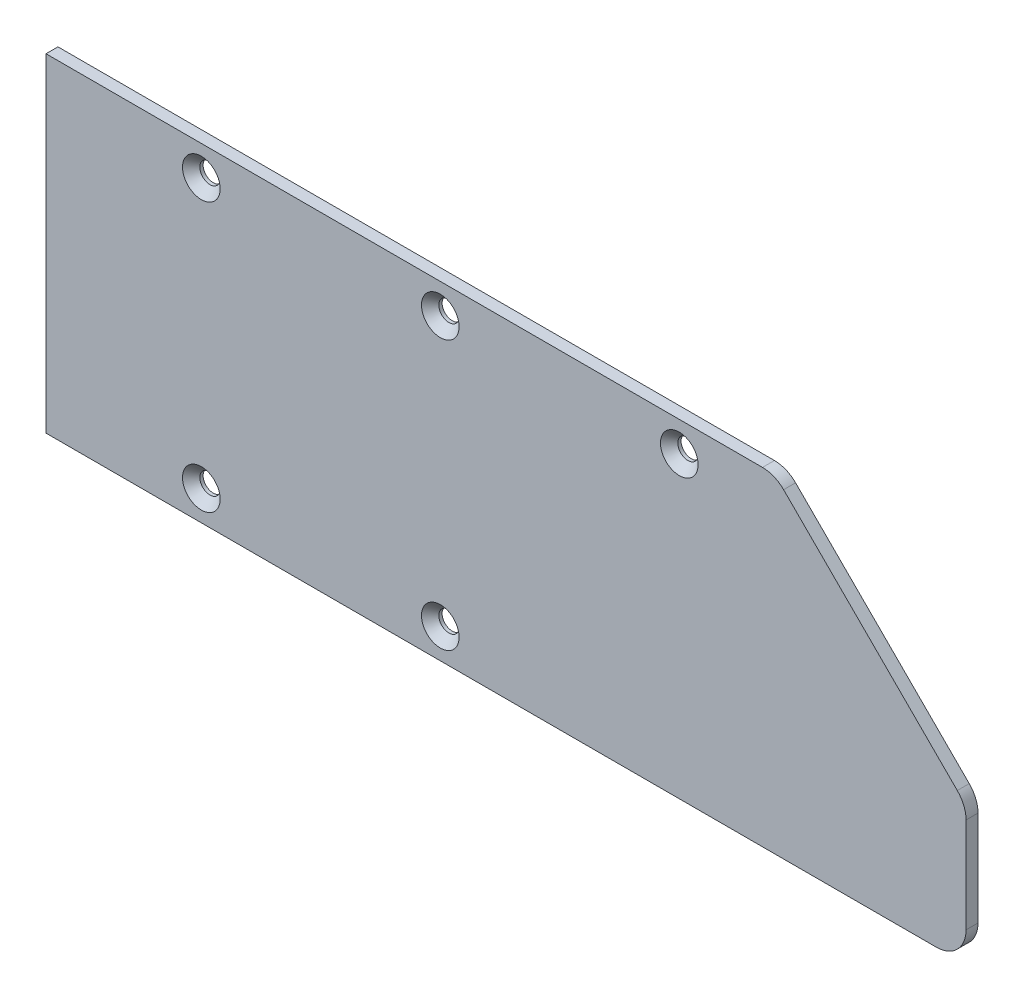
ISO-10303-21;
HEADER;
FILE_DESCRIPTION(('STEP AP214'),'2;1');
FILE_NAME('part.step','',(''),(''),'','','');
FILE_SCHEMA(('AUTOMOTIVE_DESIGN { 1 0 10303 214 1 1 1 1 }'));
ENDSEC;
DATA;
#1=APPLICATION_CONTEXT('core data for automotive mechanical design processes');
#2=APPLICATION_PROTOCOL_DEFINITION('international standard','automotive_design',2000,#1);
#3=PRODUCT_CONTEXT('',#1,'mechanical');
#4=PRODUCT('Part','Part','',(#3));
#5=PRODUCT_RELATED_PRODUCT_CATEGORY('part','',(#4));
#6=PRODUCT_DEFINITION_FORMATION('','',#4);
#7=PRODUCT_DEFINITION_CONTEXT('part definition',#1,'design');
#8=PRODUCT_DEFINITION('design','',#6,#7);
#9=PRODUCT_DEFINITION_SHAPE('','',#8);
#10=(LENGTH_UNIT() NAMED_UNIT(*) SI_UNIT(.MILLI.,.METRE.));
#11=(NAMED_UNIT(*) PLANE_ANGLE_UNIT() SI_UNIT($,.RADIAN.));
#12=(NAMED_UNIT(*) SI_UNIT($,.STERADIAN.) SOLID_ANGLE_UNIT());
#13=UNCERTAINTY_MEASURE_WITH_UNIT(LENGTH_MEASURE(1.E-05),#10,'distance_accuracy_value','');
#14=(GEOMETRIC_REPRESENTATION_CONTEXT(3) GLOBAL_UNCERTAINTY_ASSIGNED_CONTEXT((#13)) GLOBAL_UNIT_ASSIGNED_CONTEXT((#10,
#11,#12)) REPRESENTATION_CONTEXT('',''));
#15=CARTESIAN_POINT('',(0.,0.,0.));
#16=DIRECTION('',(0.,0.,1.));
#17=DIRECTION('',(1.,0.,0.));
#18=AXIS2_PLACEMENT_3D('',#15,#16,#17);
#19=CARTESIAN_POINT('',(0.,55.,0.));
#20=DIRECTION('',(0.,0.,-1.));
#21=DIRECTION('',(-1.,0.,0.));
#22=AXIS2_PLACEMENT_3D('',#19,#20,#21);
#23=PLANE('',#22);
#24=CARTESIAN_POINT('',(66.,5.,0.));
#25=DIRECTION('',(0.,0.,1.));
#26=DIRECTION('',(1.,0.,0.));
#27=AXIS2_PLACEMENT_3D('',#24,#25,#26);
#28=CIRCLE('',#27,1.7);
#29=CARTESIAN_POINT('',(67.7,5.,0.));
#30=VERTEX_POINT('',#29);
#31=EDGE_CURVE('E259',#30,#30,#28,.T.);
#32=ORIENTED_EDGE('',*,*,#31,.T.);
#33=EDGE_LOOP('',(#32));
#34=FACE_BOUND('',#33,.T.);
#35=DIRECTION('',(0.,1.,0.));
#36=VECTOR('',#35,1.);
#37=CARTESIAN_POINT('',(154.,0.,0.));
#38=LINE('',#37,#36);
#39=CARTESIAN_POINT('',(154.,5.,0.));
#40=VERTEX_POINT('',#39);
#41=CARTESIAN_POINT('',(154.,20.9289321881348,0.));
#42=VERTEX_POINT('',#41);
#43=EDGE_CURVE('E109',#40,#42,#38,.T.);
#44=ORIENTED_EDGE('',*,*,#43,.F.);
#45=CARTESIAN_POINT('',(149.,5.,0.));
#46=DIRECTION('',(0.,0.,-1.));
#47=DIRECTION('',(-1.,0.,0.));
#48=AXIS2_PLACEMENT_3D('',#45,#46,#47);
#49=CIRCLE('',#48,5.);
#50=CARTESIAN_POINT('',(149.,0.,0.));
#51=VERTEX_POINT('',#50);
#52=EDGE_CURVE('E106',#40,#51,#49,.T.);
#53=ORIENTED_EDGE('',*,*,#52,.T.);
#54=DIRECTION('',(1.,0.,0.));
#55=VECTOR('',#54,1.);
#56=CARTESIAN_POINT('',(0.,0.,0.));
#57=LINE('',#56,#55);
#58=CARTESIAN_POINT('',(0.,0.,0.));
#59=VERTEX_POINT('',#58);
#60=EDGE_CURVE('E99',#59,#51,#57,.T.);
#61=ORIENTED_EDGE('',*,*,#60,.F.);
#62=DIRECTION('',(0.,-1.,0.));
#63=VECTOR('',#62,1.);
#64=CARTESIAN_POINT('',(0.,0.,0.));
#65=LINE('',#64,#63);
#66=CARTESIAN_POINT('',(0.,55.,0.));
#67=VERTEX_POINT('',#66);
#68=EDGE_CURVE('E105',#67,#59,#65,.T.);
#69=ORIENTED_EDGE('',*,*,#68,.F.);
#70=DIRECTION('',(-1.,0.,0.));
#71=VECTOR('',#70,1.);
#72=CARTESIAN_POINT('',(0.,55.,0.));
#73=LINE('',#72,#71);
#74=CARTESIAN_POINT('',(119.928932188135,55.,0.));
#75=VERTEX_POINT('',#74);
#76=EDGE_CURVE('E133',#75,#67,#73,.T.);
#77=ORIENTED_EDGE('',*,*,#76,.F.);
#78=CARTESIAN_POINT('',(119.928932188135,50.,0.));
#79=DIRECTION('',(0.,0.,-1.));
#80=DIRECTION('',(-1.,0.,0.));
#81=AXIS2_PLACEMENT_3D('',#78,#79,#80);
#82=CIRCLE('',#81,5.);
#83=CARTESIAN_POINT('',(123.464466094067,53.5355339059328,0.));
#84=VERTEX_POINT('',#83);
#85=EDGE_CURVE('E152',#75,#84,#82,.T.);
#86=ORIENTED_EDGE('',*,*,#85,.T.);
#87=DIRECTION('',(0.707106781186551,-0.707106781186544,0.));
#88=VECTOR('',#87,1.);
#89=CARTESIAN_POINT('',(60.9999999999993,116.,0.));
#90=LINE('',#89,#88);
#91=CARTESIAN_POINT('',(152.535533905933,24.4644660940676,0.));
#92=VERTEX_POINT('',#91);
#93=EDGE_CURVE('E119',#84,#92,#90,.T.);
#94=ORIENTED_EDGE('',*,*,#93,.T.);
#95=CARTESIAN_POINT('',(149.,20.9289321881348,0.));
#96=DIRECTION('',(0.,0.,-1.));
#97=DIRECTION('',(-1.,0.,0.));
#98=AXIS2_PLACEMENT_3D('',#95,#96,#97);
#99=CIRCLE('',#98,5.);
#100=EDGE_CURVE('E150',#92,#42,#99,.T.);
#101=ORIENTED_EDGE('',*,*,#100,.T.);
#102=EDGE_LOOP('',(#44,#53,#61,#69,#77,#86,#94,#101));
#103=FACE_BOUND('',#102,.T.);
#104=CARTESIAN_POINT('',(26.,5.,0.));
#105=DIRECTION('',(0.,0.,1.));
#106=DIRECTION('',(1.,0.,0.));
#107=AXIS2_PLACEMENT_3D('',#104,#105,#106);
#108=CIRCLE('',#107,1.7);
#109=CARTESIAN_POINT('',(27.7,5.,0.));
#110=VERTEX_POINT('',#109);
#111=EDGE_CURVE('E263',#110,#110,#108,.T.);
#112=ORIENTED_EDGE('',*,*,#111,.T.);
#113=EDGE_LOOP('',(#112));
#114=FACE_BOUND('',#113,.T.);
#115=CARTESIAN_POINT('',(26.,50.,0.));
#116=DIRECTION('',(0.,0.,1.));
#117=DIRECTION('',(1.,0.,0.));
#118=AXIS2_PLACEMENT_3D('',#115,#116,#117);
#119=CIRCLE('',#118,1.7);
#120=CARTESIAN_POINT('',(27.7,50.,0.));
#121=VERTEX_POINT('',#120);
#122=EDGE_CURVE('E169',#121,#121,#119,.T.);
#123=ORIENTED_EDGE('',*,*,#122,.T.);
#124=EDGE_LOOP('',(#123));
#125=FACE_BOUND('',#124,.T.);
#126=CARTESIAN_POINT('',(66.,50.,0.));
#127=DIRECTION('',(0.,0.,1.));
#128=DIRECTION('',(1.,0.,0.));
#129=AXIS2_PLACEMENT_3D('',#126,#127,#128);
#130=CIRCLE('',#129,1.7);
#131=CARTESIAN_POINT('',(67.7,50.,0.));
#132=VERTEX_POINT('',#131);
#133=EDGE_CURVE('E178',#132,#132,#130,.T.);
#134=ORIENTED_EDGE('',*,*,#133,.T.);
#135=EDGE_LOOP('',(#134));
#136=FACE_BOUND('',#135,.T.);
#137=CARTESIAN_POINT('',(106.,50.,0.));
#138=DIRECTION('',(0.,0.,1.));
#139=DIRECTION('',(1.,0.,0.));
#140=AXIS2_PLACEMENT_3D('',#137,#138,#139);
#141=CIRCLE('',#140,1.7);
#142=CARTESIAN_POINT('',(107.7,50.,0.));
#143=VERTEX_POINT('',#142);
#144=EDGE_CURVE('E187',#143,#143,#141,.T.);
#145=ORIENTED_EDGE('',*,*,#144,.T.);
#146=EDGE_LOOP('',(#145));
#147=FACE_BOUND('',#146,.T.);
#148=ADVANCED_FACE('F33',(#34,#103,#114,#125,#136,#147),#23,.T.);
#149=CARTESIAN_POINT('',(154.,0.,2.));
#150=DIRECTION('',(-1.,0.,0.));
#151=DIRECTION('',(0.,0.,1.));
#152=AXIS2_PLACEMENT_3D('',#149,#150,#151);
#153=PLANE('',#152);
#154=DIRECTION('',(0.,1.,0.));
#155=VECTOR('',#154,1.);
#156=CARTESIAN_POINT('',(154.,0.,2.));
#157=LINE('',#156,#155);
#158=CARTESIAN_POINT('',(154.,5.,2.));
#159=VERTEX_POINT('',#158);
#160=CARTESIAN_POINT('',(154.,20.9289321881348,2.));
#161=VERTEX_POINT('',#160);
#162=EDGE_CURVE('E138',#159,#161,#157,.T.);
#163=ORIENTED_EDGE('',*,*,#162,.F.);
#164=DIRECTION('',(0.,0.,-1.));
#165=VECTOR('',#164,1.);
#166=CARTESIAN_POINT('',(154.,5.,2.));
#167=LINE('',#166,#165);
#168=EDGE_CURVE('E147',#159,#40,#167,.T.);
#169=ORIENTED_EDGE('',*,*,#168,.T.);
#170=ORIENTED_EDGE('',*,*,#43,.T.);
#171=DIRECTION('',(0.,0.,-1.));
#172=VECTOR('',#171,1.);
#173=CARTESIAN_POINT('',(154.,20.9289321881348,2.));
#174=LINE('',#173,#172);
#175=EDGE_CURVE('E145',#42,#161,#174,.F.);
#176=ORIENTED_EDGE('',*,*,#175,.T.);
#177=EDGE_LOOP('',(#163,#169,#170,#176));
#178=FACE_BOUND('',#177,.T.);
#179=ADVANCED_FACE('F204',(#178),#153,.F.);
#180=CARTESIAN_POINT('',(0.,55.,2.));
#181=DIRECTION('',(0.,-1.,0.));
#182=DIRECTION('',(0.,0.,-1.));
#183=AXIS2_PLACEMENT_3D('',#180,#181,#182);
#184=PLANE('',#183);
#185=DIRECTION('',(-1.,0.,0.));
#186=VECTOR('',#185,1.);
#187=CARTESIAN_POINT('',(0.,55.,2.));
#188=LINE('',#187,#186);
#189=CARTESIAN_POINT('',(119.928932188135,55.,2.));
#190=VERTEX_POINT('',#189);
#191=CARTESIAN_POINT('',(0.,55.,2.));
#192=VERTEX_POINT('',#191);
#193=EDGE_CURVE('E140',#190,#192,#188,.T.);
#194=ORIENTED_EDGE('',*,*,#193,.F.);
#195=DIRECTION('',(0.,0.,-1.));
#196=VECTOR('',#195,1.);
#197=CARTESIAN_POINT('',(119.928932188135,55.,0.));
#198=LINE('',#197,#196);
#199=EDGE_CURVE('E161',#190,#75,#198,.T.);
#200=ORIENTED_EDGE('',*,*,#199,.T.);
#201=ORIENTED_EDGE('',*,*,#76,.T.);
#202=DIRECTION('',(0.,0.,-1.));
#203=VECTOR('',#202,1.);
#204=CARTESIAN_POINT('',(0.,55.,2.));
#205=LINE('',#204,#203);
#206=EDGE_CURVE('E120',#192,#67,#205,.T.);
#207=ORIENTED_EDGE('',*,*,#206,.F.);
#208=EDGE_LOOP('',(#194,#200,#201,#207));
#209=FACE_BOUND('',#208,.T.);
#210=ADVANCED_FACE('F196',(#209),#184,.F.);
#211=CARTESIAN_POINT('',(0.,55.,2.));
#212=DIRECTION('',(0.,0.,-1.));
#213=DIRECTION('',(-1.,0.,0.));
#214=AXIS2_PLACEMENT_3D('',#211,#212,#213);
#215=PLANE('',#214);
#216=CARTESIAN_POINT('',(66.,5.,2.));
#217=DIRECTION('',(0.,0.,1.));
#218=DIRECTION('',(1.,0.,0.));
#219=AXIS2_PLACEMENT_3D('',#216,#217,#218);
#220=CIRCLE('',#219,3.15);
#221=CARTESIAN_POINT('',(69.15,5.,2.));
#222=VERTEX_POINT('',#221);
#223=EDGE_CURVE('E264',#222,#222,#220,.T.);
#224=ORIENTED_EDGE('',*,*,#223,.F.);
#225=EDGE_LOOP('',(#224));
#226=FACE_BOUND('',#225,.T.);
#227=CARTESIAN_POINT('',(26.,5.,2.));
#228=DIRECTION('',(0.,0.,1.));
#229=DIRECTION('',(1.,0.,0.));
#230=AXIS2_PLACEMENT_3D('',#227,#228,#229);
#231=CIRCLE('',#230,3.15);
#232=CARTESIAN_POINT('',(29.15,5.,2.));
#233=VERTEX_POINT('',#232);
#234=EDGE_CURVE('E127',#233,#233,#231,.T.);
#235=ORIENTED_EDGE('',*,*,#234,.F.);
#236=EDGE_LOOP('',(#235));
#237=FACE_BOUND('',#236,.T.);
#238=DIRECTION('',(1.,0.,0.));
#239=VECTOR('',#238,1.);
#240=CARTESIAN_POINT('',(0.,0.,2.));
#241=LINE('',#240,#239);
#242=CARTESIAN_POINT('',(0.,0.,2.));
#243=VERTEX_POINT('',#242);
#244=CARTESIAN_POINT('',(149.,0.,2.));
#245=VERTEX_POINT('',#244);
#246=EDGE_CURVE('E115',#243,#245,#241,.T.);
#247=ORIENTED_EDGE('',*,*,#246,.T.);
#248=CARTESIAN_POINT('',(149.,5.,2.));
#249=DIRECTION('',(0.,0.,-1.));
#250=DIRECTION('',(-1.,0.,0.));
#251=AXIS2_PLACEMENT_3D('',#248,#249,#250);
#252=CIRCLE('',#251,5.);
#253=EDGE_CURVE('E159',#245,#159,#252,.F.);
#254=ORIENTED_EDGE('',*,*,#253,.T.);
#255=ORIENTED_EDGE('',*,*,#162,.T.);
#256=CARTESIAN_POINT('',(149.,20.9289321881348,2.));
#257=DIRECTION('',(0.,0.,-1.));
#258=DIRECTION('',(-1.,0.,0.));
#259=AXIS2_PLACEMENT_3D('',#256,#257,#258);
#260=CIRCLE('',#259,5.);
#261=CARTESIAN_POINT('',(152.535533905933,24.4644660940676,2.));
#262=VERTEX_POINT('',#261);
#263=EDGE_CURVE('E54',#161,#262,#260,.F.);
#264=ORIENTED_EDGE('',*,*,#263,.T.);
#265=DIRECTION('',(0.707106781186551,-0.707106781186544,0.));
#266=VECTOR('',#265,1.);
#267=CARTESIAN_POINT('',(60.9999999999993,116.,2.));
#268=LINE('',#267,#266);
#269=CARTESIAN_POINT('',(123.464466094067,53.5355339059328,2.));
#270=VERTEX_POINT('',#269);
#271=EDGE_CURVE('E125',#270,#262,#268,.T.);
#272=ORIENTED_EDGE('',*,*,#271,.F.);
#273=CARTESIAN_POINT('',(119.928932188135,50.,2.));
#274=DIRECTION('',(0.,0.,-1.));
#275=DIRECTION('',(-1.,0.,0.));
#276=AXIS2_PLACEMENT_3D('',#273,#274,#275);
#277=CIRCLE('',#276,5.);
#278=EDGE_CURVE('E48',#270,#190,#277,.F.);
#279=ORIENTED_EDGE('',*,*,#278,.T.);
#280=ORIENTED_EDGE('',*,*,#193,.T.);
#281=DIRECTION('',(0.,-1.,0.));
#282=VECTOR('',#281,1.);
#283=CARTESIAN_POINT('',(0.,0.,2.));
#284=LINE('',#283,#282);
#285=EDGE_CURVE('E135',#192,#243,#284,.T.);
#286=ORIENTED_EDGE('',*,*,#285,.T.);
#287=EDGE_LOOP('',(#247,#254,#255,#264,#272,#279,#280,#286));
#288=FACE_BOUND('',#287,.T.);
#289=CARTESIAN_POINT('',(26.,50.,2.));
#290=DIRECTION('',(0.,0.,1.));
#291=DIRECTION('',(1.,0.,0.));
#292=AXIS2_PLACEMENT_3D('',#289,#290,#291);
#293=CIRCLE('',#292,3.15);
#294=CARTESIAN_POINT('',(29.15,50.,2.));
#295=VERTEX_POINT('',#294);
#296=EDGE_CURVE('E172',#295,#295,#293,.T.);
#297=ORIENTED_EDGE('',*,*,#296,.F.);
#298=EDGE_LOOP('',(#297));
#299=FACE_BOUND('',#298,.T.);
#300=CARTESIAN_POINT('',(66.,50.,2.));
#301=DIRECTION('',(0.,0.,1.));
#302=DIRECTION('',(1.,0.,0.));
#303=AXIS2_PLACEMENT_3D('',#300,#301,#302);
#304=CIRCLE('',#303,3.15);
#305=CARTESIAN_POINT('',(69.15,50.,2.));
#306=VERTEX_POINT('',#305);
#307=EDGE_CURVE('E181',#306,#306,#304,.T.);
#308=ORIENTED_EDGE('',*,*,#307,.F.);
#309=EDGE_LOOP('',(#308));
#310=FACE_BOUND('',#309,.T.);
#311=CARTESIAN_POINT('',(106.,50.,2.));
#312=DIRECTION('',(0.,0.,1.));
#313=DIRECTION('',(1.,0.,0.));
#314=AXIS2_PLACEMENT_3D('',#311,#312,#313);
#315=CIRCLE('',#314,3.15);
#316=CARTESIAN_POINT('',(109.15,50.,2.));
#317=VERTEX_POINT('',#316);
#318=EDGE_CURVE('E41',#317,#317,#315,.T.);
#319=ORIENTED_EDGE('',*,*,#318,.F.);
#320=EDGE_LOOP('',(#319));
#321=FACE_BOUND('',#320,.T.);
#322=ADVANCED_FACE('F194',(#226,#237,#288,#299,#310,#321),#215,.F.);
#323=CARTESIAN_POINT('',(0.,0.,2.));
#324=DIRECTION('',(1.,0.,0.));
#325=DIRECTION('',(0.,0.,-1.));
#326=AXIS2_PLACEMENT_3D('',#323,#324,#325);
#327=PLANE('',#326);
#328=ORIENTED_EDGE('',*,*,#68,.T.);
#329=DIRECTION('',(0.,0.,-1.));
#330=VECTOR('',#329,1.);
#331=CARTESIAN_POINT('',(0.,0.,2.));
#332=LINE('',#331,#330);
#333=EDGE_CURVE('E112',#243,#59,#332,.T.);
#334=ORIENTED_EDGE('',*,*,#333,.F.);
#335=ORIENTED_EDGE('',*,*,#285,.F.);
#336=ORIENTED_EDGE('',*,*,#206,.T.);
#337=EDGE_LOOP('',(#328,#334,#335,#336));
#338=FACE_BOUND('',#337,.T.);
#339=ADVANCED_FACE('F123',(#338),#327,.F.);
#340=CARTESIAN_POINT('',(0.,0.,2.));
#341=DIRECTION('',(0.,1.,0.));
#342=DIRECTION('',(0.,0.,1.));
#343=AXIS2_PLACEMENT_3D('',#340,#341,#342);
#344=PLANE('',#343);
#345=ORIENTED_EDGE('',*,*,#60,.T.);
#346=DIRECTION('',(0.,0.,-1.));
#347=VECTOR('',#346,1.);
#348=CARTESIAN_POINT('',(149.,0.,2.));
#349=LINE('',#348,#347);
#350=EDGE_CURVE('E155',#51,#245,#349,.F.);
#351=ORIENTED_EDGE('',*,*,#350,.T.);
#352=ORIENTED_EDGE('',*,*,#246,.F.);
#353=ORIENTED_EDGE('',*,*,#333,.T.);
#354=EDGE_LOOP('',(#345,#351,#352,#353));
#355=FACE_BOUND('',#354,.T.);
#356=ADVANCED_FACE('F113',(#355),#344,.F.);
#357=CARTESIAN_POINT('',(122.,55.,208.923732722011));
#358=DIRECTION('',(0.707106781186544,0.707106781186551,0.));
#359=DIRECTION('',(-0.707106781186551,0.707106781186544,0.));
#360=AXIS2_PLACEMENT_3D('',#357,#358,#359);
#361=PLANE('',#360);
#362=ORIENTED_EDGE('',*,*,#93,.F.);
#363=DIRECTION('',(0.,0.,-1.));
#364=VECTOR('',#363,1.);
#365=CARTESIAN_POINT('',(123.464466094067,53.5355339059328,2.));
#366=LINE('',#365,#364);
#367=EDGE_CURVE('E167',#84,#270,#366,.F.);
#368=ORIENTED_EDGE('',*,*,#367,.T.);
#369=ORIENTED_EDGE('',*,*,#271,.T.);
#370=DIRECTION('',(0.,0.,-1.));
#371=VECTOR('',#370,1.);
#372=CARTESIAN_POINT('',(152.535533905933,24.4644660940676,0.));
#373=LINE('',#372,#371);
#374=EDGE_CURVE('E164',#262,#92,#373,.T.);
#375=ORIENTED_EDGE('',*,*,#374,.T.);
#376=EDGE_LOOP('',(#362,#368,#369,#375));
#377=FACE_BOUND('',#376,.T.);
#378=ADVANCED_FACE('F219',(#377),#361,.T.);
#379=CARTESIAN_POINT('',(149.,5.,2.));
#380=DIRECTION('',(0.,0.,-1.));
#381=DIRECTION('',(-1.,0.,0.));
#382=AXIS2_PLACEMENT_3D('',#379,#380,#381);
#383=CYLINDRICAL_SURFACE('',#382,5.);
#384=ORIENTED_EDGE('',*,*,#253,.F.);
#385=ORIENTED_EDGE('',*,*,#350,.F.);
#386=ORIENTED_EDGE('',*,*,#52,.F.);
#387=ORIENTED_EDGE('',*,*,#168,.F.);
#388=EDGE_LOOP('',(#384,#385,#386,#387));
#389=FACE_BOUND('',#388,.T.);
#390=ADVANCED_FACE('F222',(#389),#383,.T.);
#391=CARTESIAN_POINT('',(119.928932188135,50.,2.));
#392=DIRECTION('',(0.,0.,1.));
#393=DIRECTION('',(1.,0.,0.));
#394=AXIS2_PLACEMENT_3D('',#391,#392,#393);
#395=CYLINDRICAL_SURFACE('',#394,5.);
#396=ORIENTED_EDGE('',*,*,#278,.F.);
#397=ORIENTED_EDGE('',*,*,#367,.F.);
#398=ORIENTED_EDGE('',*,*,#85,.F.);
#399=ORIENTED_EDGE('',*,*,#199,.F.);
#400=EDGE_LOOP('',(#396,#397,#398,#399));
#401=FACE_BOUND('',#400,.T.);
#402=ADVANCED_FACE('F226',(#401),#395,.T.);
#403=CARTESIAN_POINT('',(149.,20.9289321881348,208.923732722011));
#404=DIRECTION('',(0.,0.,1.));
#405=DIRECTION('',(1.,0.,0.));
#406=AXIS2_PLACEMENT_3D('',#403,#404,#405);
#407=CYLINDRICAL_SURFACE('',#406,5.);
#408=ORIENTED_EDGE('',*,*,#263,.F.);
#409=ORIENTED_EDGE('',*,*,#175,.F.);
#410=ORIENTED_EDGE('',*,*,#100,.F.);
#411=ORIENTED_EDGE('',*,*,#374,.F.);
#412=EDGE_LOOP('',(#408,#409,#410,#411));
#413=FACE_BOUND('',#412,.T.);
#414=ADVANCED_FACE('F230',(#413),#407,.T.);
#415=CARTESIAN_POINT('',(26.,5.,2.));
#416=DIRECTION('',(0.,0.,1.));
#417=DIRECTION('',(1.,0.,0.));
#418=AXIS2_PLACEMENT_3D('',#415,#416,#417);
#419=CONICAL_SURFACE('',#418,3.15,0.785398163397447);
#420=CARTESIAN_POINT('',(26.,5.,0.549999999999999));
#421=DIRECTION('',(0.,0.,1.));
#422=DIRECTION('',(1.,0.,0.));
#423=AXIS2_PLACEMENT_3D('',#420,#421,#422);
#424=CIRCLE('',#423,1.7);
#425=CARTESIAN_POINT('',(27.7,5.,0.549999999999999));
#426=VERTEX_POINT('',#425);
#427=EDGE_CURVE('E267',#426,#426,#424,.T.);
#428=ORIENTED_EDGE('',*,*,#427,.F.);
#429=EDGE_LOOP('',(#428));
#430=FACE_BOUND('',#429,.T.);
#431=ORIENTED_EDGE('',*,*,#234,.T.);
#432=EDGE_LOOP('',(#431));
#433=FACE_BOUND('',#432,.T.);
#434=ADVANCED_FACE('F234',(#430,#433),#419,.F.);
#435=CARTESIAN_POINT('',(26.,5.,2.));
#436=DIRECTION('',(0.,0.,1.));
#437=DIRECTION('',(1.,0.,0.));
#438=AXIS2_PLACEMENT_3D('',#435,#436,#437);
#439=CYLINDRICAL_SURFACE('',#438,1.7);
#440=ORIENTED_EDGE('',*,*,#111,.F.);
#441=EDGE_LOOP('',(#440));
#442=FACE_BOUND('',#441,.T.);
#443=ORIENTED_EDGE('',*,*,#427,.T.);
#444=EDGE_LOOP('',(#443));
#445=FACE_BOUND('',#444,.T.);
#446=ADVANCED_FACE('F238',(#442,#445),#439,.F.);
#447=CARTESIAN_POINT('',(66.,5.,2.));
#448=DIRECTION('',(0.,0.,1.));
#449=DIRECTION('',(1.,0.,0.));
#450=AXIS2_PLACEMENT_3D('',#447,#448,#449);
#451=CONICAL_SURFACE('',#450,3.15,0.785398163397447);
#452=CARTESIAN_POINT('',(66.,5.,0.549999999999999));
#453=DIRECTION('',(0.,0.,1.));
#454=DIRECTION('',(1.,0.,0.));
#455=AXIS2_PLACEMENT_3D('',#452,#453,#454);
#456=CIRCLE('',#455,1.7);
#457=CARTESIAN_POINT('',(67.7,5.,0.549999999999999));
#458=VERTEX_POINT('',#457);
#459=EDGE_CURVE('E262',#458,#458,#456,.T.);
#460=ORIENTED_EDGE('',*,*,#459,.F.);
#461=EDGE_LOOP('',(#460));
#462=FACE_BOUND('',#461,.T.);
#463=ORIENTED_EDGE('',*,*,#223,.T.);
#464=EDGE_LOOP('',(#463));
#465=FACE_BOUND('',#464,.T.);
#466=ADVANCED_FACE('F242',(#462,#465),#451,.F.);
#467=CARTESIAN_POINT('',(66.,5.,2.));
#468=DIRECTION('',(0.,0.,1.));
#469=DIRECTION('',(1.,0.,0.));
#470=AXIS2_PLACEMENT_3D('',#467,#468,#469);
#471=CYLINDRICAL_SURFACE('',#470,1.7);
#472=ORIENTED_EDGE('',*,*,#31,.F.);
#473=EDGE_LOOP('',(#472));
#474=FACE_BOUND('',#473,.T.);
#475=ORIENTED_EDGE('',*,*,#459,.T.);
#476=EDGE_LOOP('',(#475));
#477=FACE_BOUND('',#476,.T.);
#478=ADVANCED_FACE('F244',(#474,#477),#471,.F.);
#479=CARTESIAN_POINT('',(26.,50.,2.));
#480=DIRECTION('',(0.,0.,1.));
#481=DIRECTION('',(1.,0.,0.));
#482=AXIS2_PLACEMENT_3D('',#479,#480,#481);
#483=CYLINDRICAL_SURFACE('',#482,1.7);
#484=ORIENTED_EDGE('',*,*,#122,.F.);
#485=EDGE_LOOP('',(#484));
#486=FACE_BOUND('',#485,.T.);
#487=CARTESIAN_POINT('',(26.,50.,0.549999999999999));
#488=DIRECTION('',(0.,0.,1.));
#489=DIRECTION('',(1.,0.,0.));
#490=AXIS2_PLACEMENT_3D('',#487,#488,#489);
#491=CIRCLE('',#490,1.7);
#492=CARTESIAN_POINT('',(27.7,50.,0.549999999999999));
#493=VERTEX_POINT('',#492);
#494=EDGE_CURVE('E175',#493,#493,#491,.T.);
#495=ORIENTED_EDGE('',*,*,#494,.T.);
#496=EDGE_LOOP('',(#495));
#497=FACE_BOUND('',#496,.T.);
#498=ADVANCED_FACE('F248',(#486,#497),#483,.F.);
#499=CARTESIAN_POINT('',(26.,50.,2.));
#500=DIRECTION('',(0.,0.,1.));
#501=DIRECTION('',(1.,0.,0.));
#502=AXIS2_PLACEMENT_3D('',#499,#500,#501);
#503=CONICAL_SURFACE('',#502,3.15,0.785398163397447);
#504=ORIENTED_EDGE('',*,*,#494,.F.);
#505=EDGE_LOOP('',(#504));
#506=FACE_BOUND('',#505,.T.);
#507=ORIENTED_EDGE('',*,*,#296,.T.);
#508=EDGE_LOOP('',(#507));
#509=FACE_BOUND('',#508,.T.);
#510=ADVANCED_FACE('F254',(#506,#509),#503,.F.);
#511=CARTESIAN_POINT('',(66.,50.,2.));
#512=DIRECTION('',(0.,0.,1.));
#513=DIRECTION('',(1.,0.,0.));
#514=AXIS2_PLACEMENT_3D('',#511,#512,#513);
#515=CYLINDRICAL_SURFACE('',#514,1.7);
#516=ORIENTED_EDGE('',*,*,#133,.F.);
#517=EDGE_LOOP('',(#516));
#518=FACE_BOUND('',#517,.T.);
#519=CARTESIAN_POINT('',(66.,50.,0.549999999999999));
#520=DIRECTION('',(0.,0.,1.));
#521=DIRECTION('',(1.,0.,0.));
#522=AXIS2_PLACEMENT_3D('',#519,#520,#521);
#523=CIRCLE('',#522,1.7);
#524=CARTESIAN_POINT('',(67.7,50.,0.549999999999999));
#525=VERTEX_POINT('',#524);
#526=EDGE_CURVE('E184',#525,#525,#523,.T.);
#527=ORIENTED_EDGE('',*,*,#526,.T.);
#528=EDGE_LOOP('',(#527));
#529=FACE_BOUND('',#528,.T.);
#530=ADVANCED_FACE('F285',(#518,#529),#515,.F.);
#531=CARTESIAN_POINT('',(66.,50.,2.));
#532=DIRECTION('',(0.,0.,1.));
#533=DIRECTION('',(1.,0.,0.));
#534=AXIS2_PLACEMENT_3D('',#531,#532,#533);
#535=CONICAL_SURFACE('',#534,3.15,0.785398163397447);
#536=ORIENTED_EDGE('',*,*,#526,.F.);
#537=EDGE_LOOP('',(#536));
#538=FACE_BOUND('',#537,.T.);
#539=ORIENTED_EDGE('',*,*,#307,.T.);
#540=EDGE_LOOP('',(#539));
#541=FACE_BOUND('',#540,.T.);
#542=ADVANCED_FACE('F283',(#538,#541),#535,.F.);
#543=CARTESIAN_POINT('',(106.,50.,2.));
#544=DIRECTION('',(0.,0.,1.));
#545=DIRECTION('',(1.,0.,0.));
#546=AXIS2_PLACEMENT_3D('',#543,#544,#545);
#547=CYLINDRICAL_SURFACE('',#546,1.7);
#548=ORIENTED_EDGE('',*,*,#144,.F.);
#549=EDGE_LOOP('',(#548));
#550=FACE_BOUND('',#549,.T.);
#551=CARTESIAN_POINT('',(106.,50.,0.549999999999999));
#552=DIRECTION('',(0.,0.,1.));
#553=DIRECTION('',(1.,0.,0.));
#554=AXIS2_PLACEMENT_3D('',#551,#552,#553);
#555=CIRCLE('',#554,1.7);
#556=CARTESIAN_POINT('',(107.7,50.,0.549999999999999));
#557=VERTEX_POINT('',#556);
#558=EDGE_CURVE('E11',#557,#557,#555,.T.);
#559=ORIENTED_EDGE('',*,*,#558,.T.);
#560=EDGE_LOOP('',(#559));
#561=FACE_BOUND('',#560,.T.);
#562=ADVANCED_FACE('F35',(#550,#561),#547,.F.);
#563=CARTESIAN_POINT('',(106.,50.,2.));
#564=DIRECTION('',(0.,0.,1.));
#565=DIRECTION('',(1.,0.,0.));
#566=AXIS2_PLACEMENT_3D('',#563,#564,#565);
#567=CONICAL_SURFACE('',#566,3.15,0.785398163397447);
#568=ORIENTED_EDGE('',*,*,#558,.F.);
#569=EDGE_LOOP('',(#568));
#570=FACE_BOUND('',#569,.T.);
#571=ORIENTED_EDGE('',*,*,#318,.T.);
#572=EDGE_LOOP('',(#571));
#573=FACE_BOUND('',#572,.T.);
#574=ADVANCED_FACE('F192',(#570,#573),#567,.F.);
#575=CLOSED_SHELL('',(#148,#179,#210,#322,#339,#356,#378,#390,#402,#414,#434,#446,#466,#478,
#498,#510,#530,#542,#562,#574));
#576=MANIFOLD_SOLID_BREP('B2',#575);
#577=ADVANCED_BREP_SHAPE_REPRESENTATION('',(#18,#576),#14);
#578=SHAPE_DEFINITION_REPRESENTATION(#9,#577);
ENDSEC;
END-ISO-10303-21;
